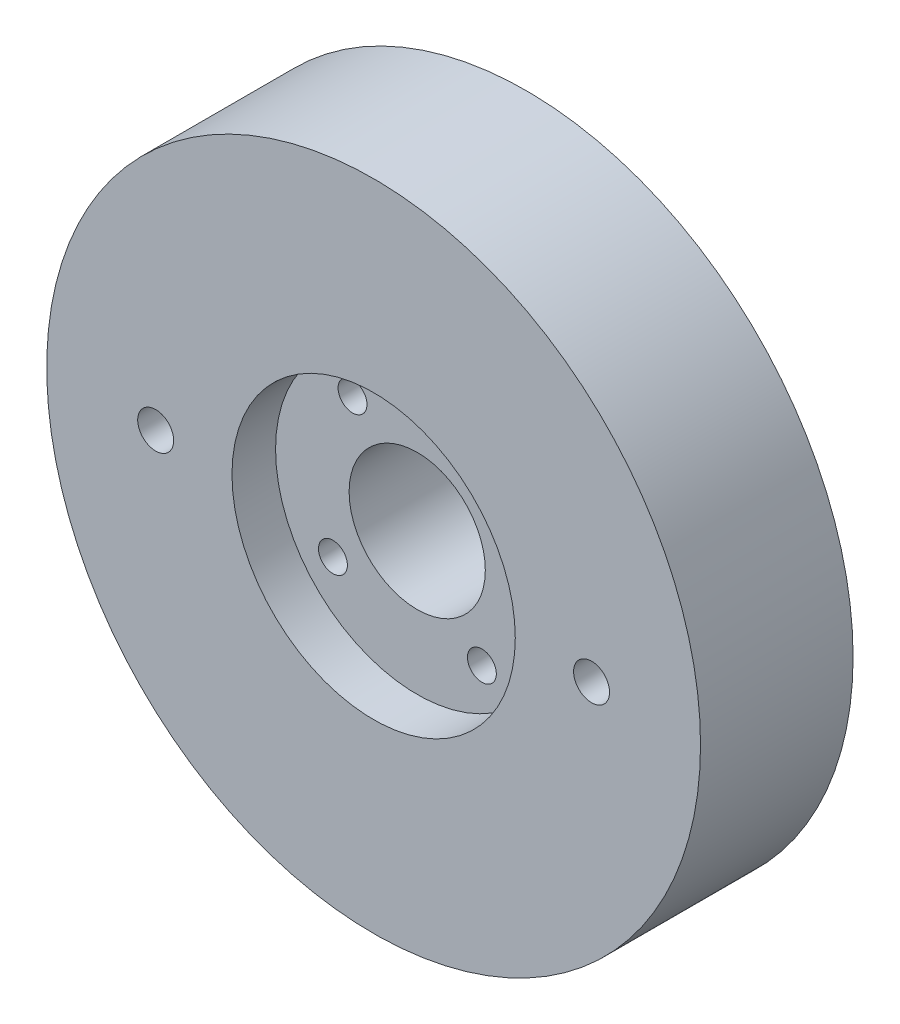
from build123d import *

# Parameters (mm, degrees)
ESQUISSE1_R                       = 60
BOSS_EXTRU_1_DEPTH                = 28
ESQUISSE2_R                       = 26
ENL_V_MAT_EXTRU_1_DEPTH           = 8
D_GAGEMENT_M62_D                  = 6.6
DIAM_TRE_DU_PER_AGE_4_0_4_2_D     = 4
DIAM_TRE_DU_PER_AGE_4_0_4_2_DEPTH = 10
DIAM_TRE_DU_PER_AGE_4_0_4_2_TIP   = 1.201721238
ESQUISSE9_R                       = 12.5
ENL_V_MAT_EXTRU_4_DEPTH           = 90.353231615
DIAM_TRE_DU_PER_AGE_5_3_5_3_1_D   = 5.3
ESQUISSE7_R                       = 5
ENL_V_MAT_EXTRU_3_DEPTH           = 7.5
CHANFREIN6_SIZE                   = 0.5


with BuildPart() as part:
    # Esquisse1 → Boss.-Extru.1 (new body)
    with BuildSketch(Plane.XY):
        Circle(ESQUISSE1_R)
    extrude(amount=BOSS_EXTRU_1_DEPTH)

    # Esquisse2 → Enl_v. mat.-Extru.1 (cut)
    with BuildSketch(Plane.XY.offset(28)):
        Circle(ESQUISSE2_R)
    extrude(amount=-ENL_V_MAT_EXTRU_1_DEPTH, mode=Mode.SUBTRACT)

    # D_gagement M62 (through all)
    with Locations(Plane.XY.offset(28)):
        with Locations((-40, 0), (40, 0)):
            Hole(D_GAGEMENT_M62_D / 2)

    # Diam_tre du per_age _4.0 _4_2
    with Locations(Plane.XY.offset(20)):
        with Locations((19.5, 0)):
            Hole(DIAM_TRE_DU_PER_AGE_4_0_4_2_D / 2, depth=DIAM_TRE_DU_PER_AGE_4_0_4_2_DEPTH)
            with Locations((0, 0, -(DIAM_TRE_DU_PER_AGE_4_0_4_2_DEPTH + DIAM_TRE_DU_PER_AGE_4_0_4_2_TIP / 2))):  # 118° drill point
                Cone(0, DIAM_TRE_DU_PER_AGE_4_0_4_2_D / 2, DIAM_TRE_DU_PER_AGE_4_0_4_2_TIP, mode=Mode.SUBTRACT)

    # Esquisse9 → Enl_v. mat.-Extru.4 (cut, through all)
    with BuildSketch(Plane(origin=(0, 0, 0), x_dir=(-1, 0, 0), z_dir=(0, 0, -1))):
        Circle(ESQUISSE9_R)
    extrude(amount=-ENL_V_MAT_EXTRU_4_DEPTH, mode=Mode.SUBTRACT)

    # Diam_tre du per_age _5.3 _5.3_1 (through all)
    with Locations(Plane(origin=(0, 0, 0), x_dir=(-1, 0, 0), z_dir=(0, 0, -1))):
        with Locations((-15.470390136, 11.870847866), (-11.870847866, -15.470390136), (15.470390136, -11.870847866), (11.870847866, 15.470390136)):
            Hole(DIAM_TRE_DU_PER_AGE_5_3_5_3_1_D / 2)

    # Esquisse7 → Enl_v. mat.-Extru.3 (cut)
    with BuildSketch(Plane(origin=(0, 0, 0), x_dir=(-1, 0, 0), z_dir=(0, 0, -1))):
        with Locations((-15.470390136, 11.870847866)):
            Circle(ESQUISSE7_R)
        with Locations((11.870847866, 15.470390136)):
            Circle(ESQUISSE7_R)
        with Locations((-11.870847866, -15.470390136)):
            Circle(ESQUISSE7_R)
        with Locations((15.470390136, -11.870847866)):
            Circle(ESQUISSE7_R)
    extrude(amount=-ENL_V_MAT_EXTRU_3_DEPTH, mode=Mode.SUBTRACT)

    # Chanfrein6
    chanfrein6_edges = [part.edges().sort_by_distance(p)[0] for p in [
        (21.5, 0, 20),
    ]]
    chamfer(chanfrein6_edges, length=CHANFREIN6_SIZE)


solid = part.part
